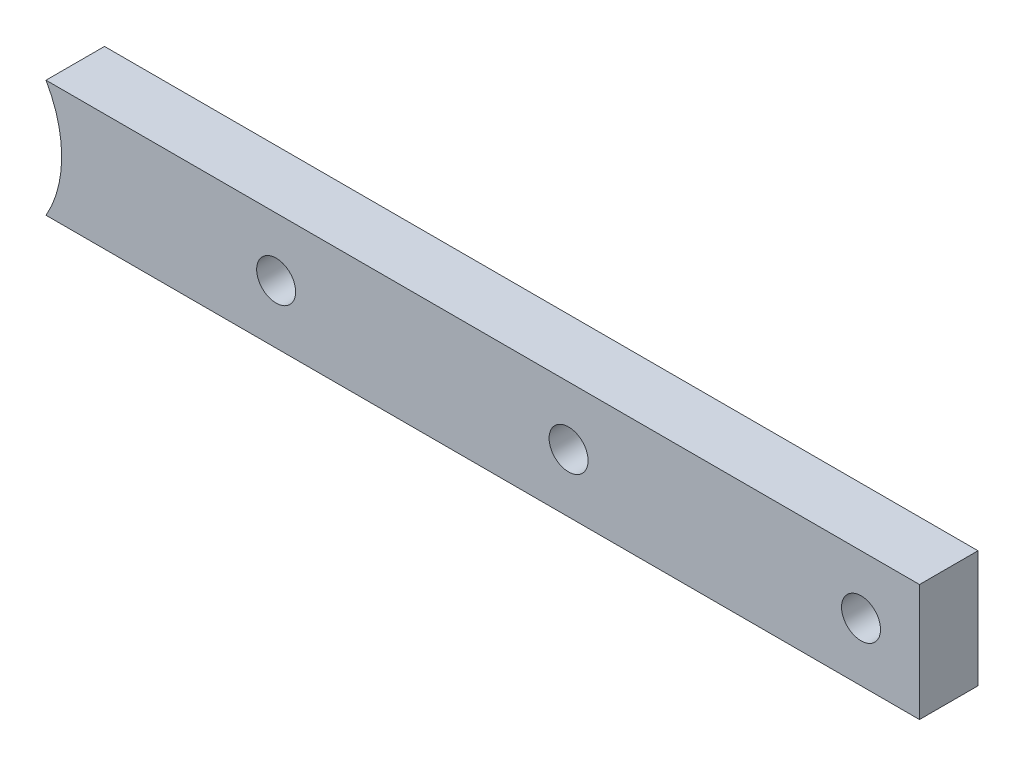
from build123d import *

# Parameters (mm, degrees)
ESQUISSE1_R      = 10
EXTRUSION1_DEPTH = 30


with BuildPart() as part:
    # Esquisse1 → Extrusion1 (new body)
    with BuildSketch(Plane.XY):
        with BuildLine():
            Line((51.961524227, 30), (500, 30))
            Line((500, 30), (500, -30))
            Line((500, -30), (51.961524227, -30))
            ThreePointArc((51.961524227, -30), (60, 0), (51.961524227, 30))
        make_face()
        with Locations((470, 0)):
            Circle(ESQUISSE1_R, mode=Mode.SUBTRACT)
        with Locations((320, 0)):
            Circle(ESQUISSE1_R, mode=Mode.SUBTRACT)
        with Locations((170, 0)):
            Circle(ESQUISSE1_R, mode=Mode.SUBTRACT)
    extrude(amount=EXTRUSION1_DEPTH)


solid = part.part
